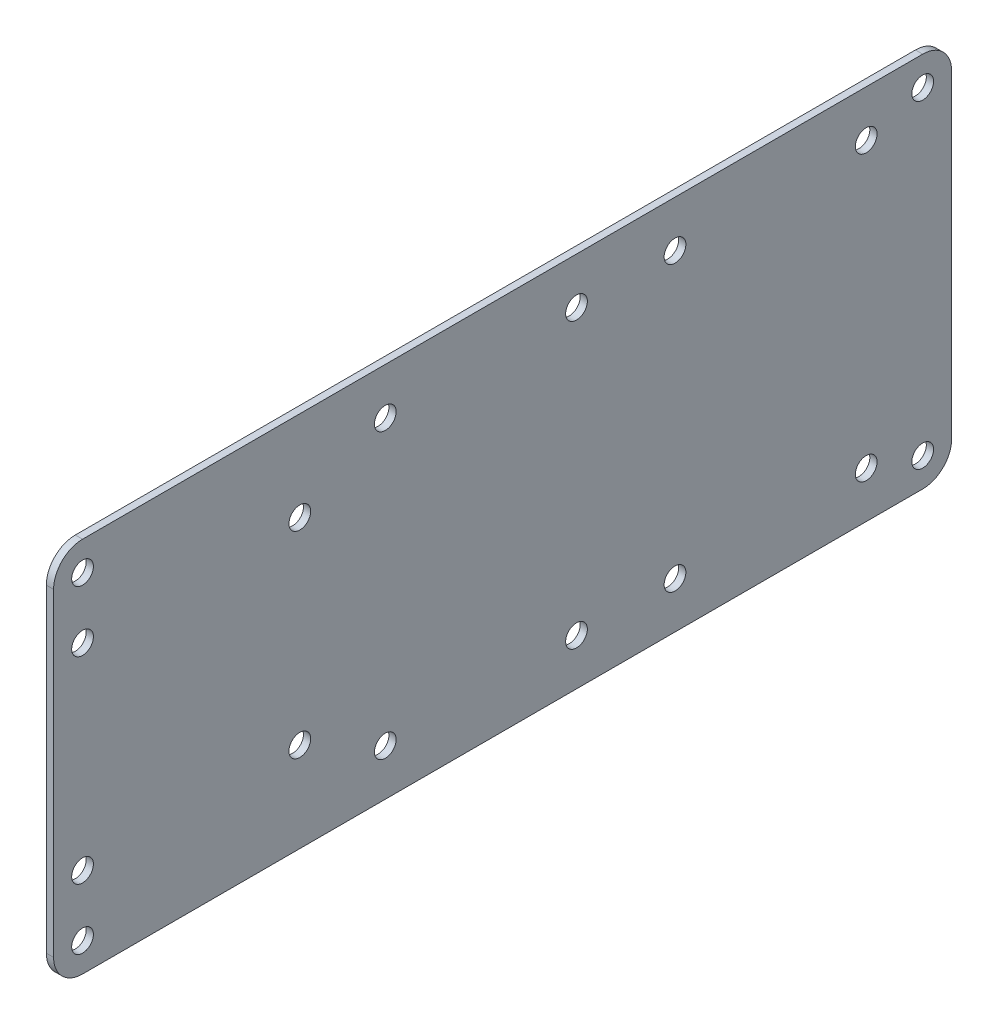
from build123d import *

# Parameters (mm, degrees)
SKETCH1_W           = 196.85
SKETCH1_H           = 82.55
SKETCH1_R           = 2.38125
BOSS_EXTRUDE1_DEPTH = 1.5875
SKETCH2_R           = 2.38125
CUT_EXTRUDE1_DEPTH  = 1.5875
FILLET1_R           = 6.35


with BuildPart() as part:
    # Sketch1 → Boss-Extrude1 (new body)
    with BuildSketch(Plane(origin=(0, 0, 0), x_dir=(0, 0, -1), z_dir=(1, 0, 0))):
        with Locations((98.425, -41.275)):
            Rectangle(SKETCH1_W, SKETCH1_H)
        with Locations((6.35, -6.35)):
            Circle(SKETCH1_R, mode=Mode.SUBTRACT)
        with Locations((6.35, -76.2)):
            Circle(SKETCH1_R, mode=Mode.SUBTRACT)
        with Locations((190.5, -76.2)):
            Circle(SKETCH1_R, mode=Mode.SUBTRACT)
        with Locations((190.5, -6.35)):
            Circle(SKETCH1_R, mode=Mode.SUBTRACT)
    extrude(amount=BOSS_EXTRUDE1_DEPTH)

    # Sketch2 → Cut-Extrude1 (cut)
    with BuildSketch(Plane(origin=(1.5875, 0, 0), x_dir=(0, 0, -1), z_dir=(1, 0, 0))):
        with Locations((6.35, -19.685)):
            Circle(SKETCH2_R)
        with Locations((6.35, -62.865)):
            Circle(SKETCH2_R)
        with Locations((53.975, -62.865)):
            Circle(SKETCH2_R)
        with Locations((53.975, -19.685)):
            Circle(SKETCH2_R)
        with Locations((72.7075, -10.16)):
            Circle(SKETCH2_R)
        with Locations((114.6175, -10.16)):
            Circle(SKETCH2_R)
        with Locations((114.6175, -72.39)):
            Circle(SKETCH2_R)
        with Locations((72.7075, -72.39)):
            Circle(SKETCH2_R)
        with Locations((136.2075, -72.39)):
            Circle(SKETCH2_R)
        with Locations((136.2075, -10.16)):
            Circle(SKETCH2_R)
        with Locations((178.1175, -10.16)):
            Circle(SKETCH2_R)
        with Locations((178.1175, -72.39)):
            Circle(SKETCH2_R)
    extrude(amount=-CUT_EXTRUDE1_DEPTH, mode=Mode.SUBTRACT)

    # Fillet1
    fillet1_edges = [part.edges().sort_by_distance(p)[0] for p in [
        (0.79375, 0, 0),
        (0.79375, 0, -196.85),
        (0.79375, -82.55, -196.85),
        (0.79375, -82.55, 0),
    ]]
    fillet(fillet1_edges, radius=FILLET1_R)


solid = part.part
